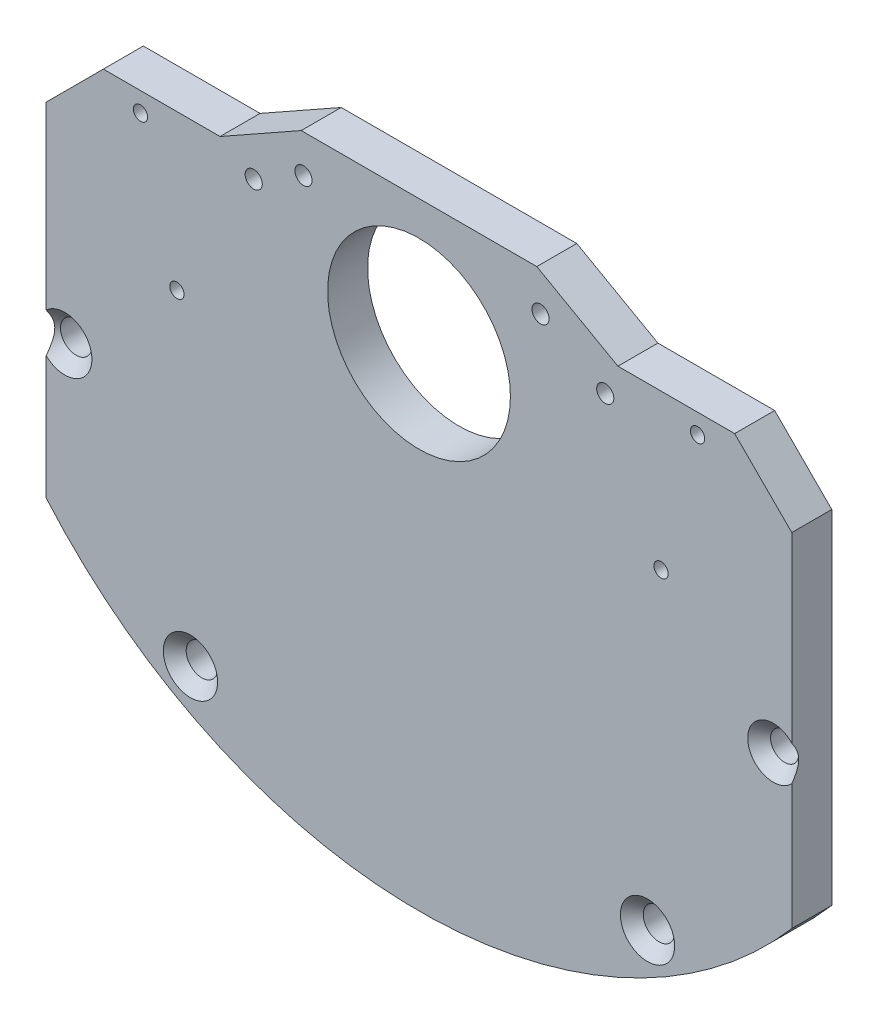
ISO-10303-21;
HEADER;
FILE_DESCRIPTION(('STEP AP214'),'2;1');
FILE_NAME('part.step','',(''),(''),'','','');
FILE_SCHEMA(('AUTOMOTIVE_DESIGN { 1 0 10303 214 1 1 1 1 }'));
ENDSEC;
DATA;
#1=APPLICATION_CONTEXT('core data for automotive mechanical design processes');
#2=APPLICATION_PROTOCOL_DEFINITION('international standard','automotive_design',2000,#1);
#3=PRODUCT_CONTEXT('',#1,'mechanical');
#4=PRODUCT('Part','Part','',(#3));
#5=PRODUCT_RELATED_PRODUCT_CATEGORY('part','',(#4));
#6=PRODUCT_DEFINITION_FORMATION('','',#4);
#7=PRODUCT_DEFINITION_CONTEXT('part definition',#1,'design');
#8=PRODUCT_DEFINITION('design','',#6,#7);
#9=PRODUCT_DEFINITION_SHAPE('','',#8);
#10=(LENGTH_UNIT() NAMED_UNIT(*) SI_UNIT(.MILLI.,.METRE.));
#11=(NAMED_UNIT(*) PLANE_ANGLE_UNIT() SI_UNIT($,.RADIAN.));
#12=(NAMED_UNIT(*) SI_UNIT($,.STERADIAN.) SOLID_ANGLE_UNIT());
#13=UNCERTAINTY_MEASURE_WITH_UNIT(LENGTH_MEASURE(1.E-05),#10,'distance_accuracy_value','');
#14=(GEOMETRIC_REPRESENTATION_CONTEXT(3) GLOBAL_UNCERTAINTY_ASSIGNED_CONTEXT((#13)) GLOBAL_UNIT_ASSIGNED_CONTEXT((#10,
#11,#12)) REPRESENTATION_CONTEXT('',''));
#15=CARTESIAN_POINT('',(0.,0.,0.));
#16=DIRECTION('',(0.,0.,1.));
#17=DIRECTION('',(1.,0.,0.));
#18=AXIS2_PLACEMENT_3D('',#15,#16,#17);
#19=CARTESIAN_POINT('',(0.,0.,7.));
#20=DIRECTION('',(0.,0.,1.));
#21=DIRECTION('',(1.,0.,0.));
#22=AXIS2_PLACEMENT_3D('',#19,#20,#21);
#23=PLANE('',#22);
#24=CARTESIAN_POINT('',(-48.7540525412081,10.5767367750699,7.));
#25=DIRECTION('',(0.,0.,1.));
#26=DIRECTION('',(1.,0.,0.));
#27=AXIS2_PLACEMENT_3D('',#24,#25,#26);
#28=CIRCLE('',#27,1.24999999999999);
#29=CARTESIAN_POINT('',(-47.5040525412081,10.5767367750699,7.));
#30=VERTEX_POINT('',#29);
#31=EDGE_CURVE('E371',#30,#30,#28,.T.);
#32=ORIENTED_EDGE('',*,*,#31,.F.);
#33=EDGE_LOOP('',(#32));
#34=FACE_BOUND('',#33,.T.);
#35=CARTESIAN_POINT('',(-42.3670414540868,-13.0919363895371,7.));
#36=DIRECTION('',(0.,0.,1.));
#37=DIRECTION('',(1.,0.,0.));
#38=AXIS2_PLACEMENT_3D('',#35,#36,#37);
#39=CIRCLE('',#38,1.24999999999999);
#40=CARTESIAN_POINT('',(-41.1170414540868,-13.0919363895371,7.));
#41=VERTEX_POINT('',#40);
#42=EDGE_CURVE('E365',#41,#41,#39,.T.);
#43=ORIENTED_EDGE('',*,*,#42,.F.);
#44=EDGE_LOOP('',(#43));
#45=FACE_BOUND('',#44,.T.);
#46=CARTESIAN_POINT('',(48.7540525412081,10.5767367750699,7.));
#47=DIRECTION('',(0.,0.,1.));
#48=DIRECTION('',(1.,0.,0.));
#49=AXIS2_PLACEMENT_3D('',#46,#47,#48);
#50=CIRCLE('',#49,1.24999999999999);
#51=CARTESIAN_POINT('',(50.0040525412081,10.5767367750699,7.));
#52=VERTEX_POINT('',#51);
#53=EDGE_CURVE('E359',#52,#52,#50,.T.);
#54=ORIENTED_EDGE('',*,*,#53,.F.);
#55=EDGE_LOOP('',(#54));
#56=FACE_BOUND('',#55,.T.);
#57=CARTESIAN_POINT('',(42.3670414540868,-13.0919363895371,7.));
#58=DIRECTION('',(0.,0.,1.));
#59=DIRECTION('',(1.,0.,0.));
#60=AXIS2_PLACEMENT_3D('',#57,#58,#59);
#61=CIRCLE('',#60,1.24999999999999);
#62=CARTESIAN_POINT('',(43.6170414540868,-13.0919363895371,7.));
#63=VERTEX_POINT('',#62);
#64=EDGE_CURVE('E353',#63,#63,#61,.T.);
#65=ORIENTED_EDGE('',*,*,#64,.F.);
#66=EDGE_LOOP('',(#65));
#67=FACE_BOUND('',#66,.T.);
#68=CARTESIAN_POINT('',(40.,-68.9092960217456,7.));
#69=DIRECTION('',(0.,0.,1.));
#70=DIRECTION('',(1.,0.,0.));
#71=AXIS2_PLACEMENT_3D('',#68,#69,#70);
#72=CIRCLE('',#71,4.75000000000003);
#73=CARTESIAN_POINT('',(44.75,-68.9092960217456,7.));
#74=VERTEX_POINT('',#73);
#75=EDGE_CURVE('E180',#74,#74,#72,.F.);
#76=ORIENTED_EDGE('',*,*,#75,.T.);
#77=EDGE_LOOP('',(#76));
#78=FACE_BOUND('',#77,.T.);
#79=CARTESIAN_POINT('',(-40.,-68.9092960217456,7.));
#80=DIRECTION('',(0.,0.,1.));
#81=DIRECTION('',(1.,0.,0.));
#82=AXIS2_PLACEMENT_3D('',#79,#80,#81);
#83=CIRCLE('',#82,4.75000000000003);
#84=CARTESIAN_POINT('',(-35.25,-68.9092960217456,7.));
#85=VERTEX_POINT('',#84);
#86=EDGE_CURVE('E177',#85,#85,#83,.F.);
#87=ORIENTED_EDGE('',*,*,#86,.T.);
#88=EDGE_LOOP('',(#87));
#89=FACE_BOUND('',#88,.T.);
#90=CARTESIAN_POINT('',(-28.9317067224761,10.4718143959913,7.));
#91=DIRECTION('',(0.,0.,-1.));
#92=DIRECTION('',(-1.,0.,0.));
#93=AXIS2_PLACEMENT_3D('',#90,#91,#92);
#94=CIRCLE('',#93,1.5);
#95=CARTESIAN_POINT('',(-30.4317067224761,10.4718143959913,7.));
#96=VERTEX_POINT('',#95);
#97=EDGE_CURVE('E344',#96,#96,#94,.T.);
#98=ORIENTED_EDGE('',*,*,#97,.T.);
#99=EDGE_LOOP('',(#98));
#100=FACE_BOUND('',#99,.T.);
#101=CARTESIAN_POINT('',(-20.2190182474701,15.3798750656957,7.));
#102=DIRECTION('',(0.,0.,-1.));
#103=DIRECTION('',(-1.,0.,0.));
#104=AXIS2_PLACEMENT_3D('',#101,#102,#103);
#105=CIRCLE('',#104,1.5);
#106=CARTESIAN_POINT('',(-21.7190182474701,15.3798750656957,7.));
#107=VERTEX_POINT('',#106);
#108=EDGE_CURVE('E338',#107,#107,#105,.T.);
#109=ORIENTED_EDGE('',*,*,#108,.T.);
#110=EDGE_LOOP('',(#109));
#111=FACE_BOUND('',#110,.T.);
#112=CARTESIAN_POINT('',(32.5976371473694,8.7558016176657,7.));
#113=DIRECTION('',(0.,0.,-1.));
#114=DIRECTION('',(-1.,0.,0.));
#115=AXIS2_PLACEMENT_3D('',#112,#113,#114);
#116=CIRCLE('',#115,1.5);
#117=CARTESIAN_POINT('',(31.0976371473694,8.7558016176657,7.));
#118=VERTEX_POINT('',#117);
#119=EDGE_CURVE('E332',#118,#118,#116,.T.);
#120=ORIENTED_EDGE('',*,*,#119,.T.);
#121=EDGE_LOOP('',(#120));
#122=FACE_BOUND('',#121,.T.);
#123=CARTESIAN_POINT('',(21.2711421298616,15.1362804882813,7.));
#124=DIRECTION('',(0.,0.,-1.));
#125=DIRECTION('',(-1.,0.,0.));
#126=AXIS2_PLACEMENT_3D('',#123,#124,#125);
#127=CIRCLE('',#126,1.5);
#128=CARTESIAN_POINT('',(19.7711421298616,15.1362804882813,7.));
#129=VERTEX_POINT('',#128);
#130=EDGE_CURVE('E326',#129,#129,#127,.T.);
#131=ORIENTED_EDGE('',*,*,#130,.T.);
#132=EDGE_LOOP('',(#131));
#133=FACE_BOUND('',#132,.T.);
#134=DIRECTION('',(0.,1.,0.));
#135=VECTOR('',#134,1.);
#136=CARTESIAN_POINT('',(65.2499999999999,4.,7.));
#137=LINE('',#136,#135);
#138=CARTESIAN_POINT('',(65.2499999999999,-56.0217591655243,7.));
#139=VERTEX_POINT('',#138);
#140=CARTESIAN_POINT('',(65.2499999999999,-34.0659130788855,7.));
#141=VERTEX_POINT('',#140);
#142=EDGE_CURVE('E125',#139,#141,#137,.T.);
#143=ORIENTED_EDGE('',*,*,#142,.T.);
#144=CARTESIAN_POINT('',(62.,-31.,7.));
#145=DIRECTION('',(0.,0.,1.));
#146=DIRECTION('',(1.,0.,0.));
#147=AXIS2_PLACEMENT_3D('',#144,#145,#146);
#148=CIRCLE('',#147,4.46792155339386);
#149=CARTESIAN_POINT('',(65.2499999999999,-27.9340869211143,7.));
#150=VERTEX_POINT('',#149);
#151=EDGE_CURVE('E183',#141,#150,#148,.F.);
#152=ORIENTED_EDGE('',*,*,#151,.T.);
#153=CARTESIAN_POINT('',(65.2499999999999,4.,7.));
#154=VERTEX_POINT('',#153);
#155=EDGE_CURVE('E137',#150,#154,#137,.T.);
#156=ORIENTED_EDGE('',*,*,#155,.T.);
#157=DIRECTION('',(-0.707106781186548,0.707106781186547,0.));
#158=VECTOR('',#157,1.);
#159=CARTESIAN_POINT('',(55.2499999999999,14.,7.));
#160=LINE('',#159,#158);
#161=CARTESIAN_POINT('',(55.2499999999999,14.,7.));
#162=VERTEX_POINT('',#161);
#163=EDGE_CURVE('E136',#154,#162,#160,.T.);
#164=ORIENTED_EDGE('',*,*,#163,.T.);
#165=DIRECTION('',(-1.,0.,0.));
#166=VECTOR('',#165,1.);
#167=CARTESIAN_POINT('',(34.8183521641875,14.,7.));
#168=LINE('',#167,#166);
#169=CARTESIAN_POINT('',(34.8183521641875,14.,7.));
#170=VERTEX_POINT('',#169);
#171=EDGE_CURVE('E307',#162,#170,#168,.T.);
#172=ORIENTED_EDGE('',*,*,#171,.T.);
#173=DIRECTION('',(-0.871268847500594,0.490806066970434,0.));
#174=VECTOR('',#173,1.);
#175=CARTESIAN_POINT('',(20.616916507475,22.,7.));
#176=LINE('',#175,#174);
#177=CARTESIAN_POINT('',(20.616916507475,22.,7.));
#178=VERTEX_POINT('',#177);
#179=EDGE_CURVE('E266',#170,#178,#176,.T.);
#180=ORIENTED_EDGE('',*,*,#179,.T.);
#181=DIRECTION('',(-1.,0.,0.));
#182=VECTOR('',#181,1.);
#183=CARTESIAN_POINT('',(-20.6169165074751,22.,7.));
#184=LINE('',#183,#182);
#185=CARTESIAN_POINT('',(-20.6169165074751,22.,7.));
#186=VERTEX_POINT('',#185);
#187=EDGE_CURVE('E301',#178,#186,#184,.T.);
#188=ORIENTED_EDGE('',*,*,#187,.T.);
#189=DIRECTION('',(-0.871268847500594,-0.490806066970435,0.));
#190=VECTOR('',#189,1.);
#191=CARTESIAN_POINT('',(-20.6169165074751,22.,7.));
#192=LINE('',#191,#190);
#193=CARTESIAN_POINT('',(-34.8183521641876,14.,7.));
#194=VERTEX_POINT('',#193);
#195=EDGE_CURVE('E303',#186,#194,#192,.T.);
#196=ORIENTED_EDGE('',*,*,#195,.T.);
#197=DIRECTION('',(-1.,0.,0.));
#198=VECTOR('',#197,1.);
#199=CARTESIAN_POINT('',(-55.25,14.,7.));
#200=LINE('',#199,#198);
#201=CARTESIAN_POINT('',(-55.25,14.,7.));
#202=VERTEX_POINT('',#201);
#203=EDGE_CURVE('E305',#194,#202,#200,.T.);
#204=ORIENTED_EDGE('',*,*,#203,.T.);
#205=DIRECTION('',(-0.707106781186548,-0.707106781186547,0.));
#206=VECTOR('',#205,1.);
#207=CARTESIAN_POINT('',(-55.25,14.,7.));
#208=LINE('',#207,#206);
#209=CARTESIAN_POINT('',(-65.25,4.,7.));
#210=VERTEX_POINT('',#209);
#211=EDGE_CURVE('E312',#202,#210,#208,.T.);
#212=ORIENTED_EDGE('',*,*,#211,.T.);
#213=DIRECTION('',(0.,-1.,0.));
#214=VECTOR('',#213,1.);
#215=CARTESIAN_POINT('',(-65.25,4.,7.));
#216=LINE('',#215,#214);
#217=CARTESIAN_POINT('',(-65.25,-27.5358983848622,7.));
#218=VERTEX_POINT('',#217);
#219=EDGE_CURVE('E287',#210,#218,#216,.T.);
#220=ORIENTED_EDGE('',*,*,#219,.T.);
#221=CARTESIAN_POINT('',(-62.,-31.,7.));
#222=DIRECTION('',(0.,0.,1.));
#223=DIRECTION('',(1.,0.,0.));
#224=AXIS2_PLACEMENT_3D('',#221,#222,#223);
#225=CIRCLE('',#224,4.75000000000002);
#226=CARTESIAN_POINT('',(-65.25,-34.4641016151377,7.));
#227=VERTEX_POINT('',#226);
#228=EDGE_CURVE('E155',#218,#227,#225,.F.);
#229=ORIENTED_EDGE('',*,*,#228,.T.);
#230=CARTESIAN_POINT('',(-65.25,-56.0217591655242,7.));
#231=VERTEX_POINT('',#230);
#232=EDGE_CURVE('E142',#227,#231,#216,.T.);
#233=ORIENTED_EDGE('',*,*,#232,.T.);
#234=CARTESIAN_POINT('',(0.,0.,7.));
#235=DIRECTION('',(0.,0.,1.));
#236=DIRECTION('',(1.,0.,0.));
#237=AXIS2_PLACEMENT_3D('',#234,#235,#236);
#238=CIRCLE('',#237,86.);
#239=EDGE_CURVE('E140',#231,#139,#238,.T.);
#240=ORIENTED_EDGE('',*,*,#239,.T.);
#241=EDGE_LOOP('',(#143,#152,#156,#164,#172,#180,#188,#196,#204,#212,#220,#229,#233,#240));
#242=FACE_BOUND('',#241,.T.);
#243=CARTESIAN_POINT('',(0.,0.,7.));
#244=DIRECTION('',(0.,0.,1.));
#245=DIRECTION('',(1.,0.,0.));
#246=AXIS2_PLACEMENT_3D('',#243,#244,#245);
#247=CIRCLE('',#246,16.);
#248=CARTESIAN_POINT('',(16.,0.,7.));
#249=VERTEX_POINT('',#248);
#250=EDGE_CURVE('E317',#249,#249,#247,.T.);
#251=ORIENTED_EDGE('',*,*,#250,.F.);
#252=EDGE_LOOP('',(#251));
#253=FACE_BOUND('',#252,.T.);
#254=ADVANCED_FACE('F33',(#34,#45,#56,#67,#78,#89,#100,#111,#122,#133,#242,#253),#23,.T.);
#255=CARTESIAN_POINT('',(0.,0.,0.));
#256=DIRECTION('',(0.,0.,1.));
#257=DIRECTION('',(1.,0.,0.));
#258=AXIS2_PLACEMENT_3D('',#255,#256,#257);
#259=PLANE('',#258);
#260=CARTESIAN_POINT('',(-48.7540525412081,10.5767367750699,0.));
#261=DIRECTION('',(0.,0.,1.));
#262=DIRECTION('',(1.,0.,0.));
#263=AXIS2_PLACEMENT_3D('',#260,#261,#262);
#264=CIRCLE('',#263,1.25);
#265=CARTESIAN_POINT('',(-47.5040525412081,10.5767367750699,0.));
#266=VERTEX_POINT('',#265);
#267=EDGE_CURVE('E368',#266,#266,#264,.T.);
#268=ORIENTED_EDGE('',*,*,#267,.T.);
#269=EDGE_LOOP('',(#268));
#270=FACE_BOUND('',#269,.T.);
#271=CARTESIAN_POINT('',(-42.3670414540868,-13.0919363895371,0.));
#272=DIRECTION('',(0.,0.,1.));
#273=DIRECTION('',(1.,0.,0.));
#274=AXIS2_PLACEMENT_3D('',#271,#272,#273);
#275=CIRCLE('',#274,1.25);
#276=CARTESIAN_POINT('',(-41.1170414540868,-13.0919363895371,0.));
#277=VERTEX_POINT('',#276);
#278=EDGE_CURVE('E362',#277,#277,#275,.T.);
#279=ORIENTED_EDGE('',*,*,#278,.T.);
#280=EDGE_LOOP('',(#279));
#281=FACE_BOUND('',#280,.T.);
#282=CARTESIAN_POINT('',(48.7540525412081,10.5767367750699,0.));
#283=DIRECTION('',(0.,0.,1.));
#284=DIRECTION('',(1.,0.,0.));
#285=AXIS2_PLACEMENT_3D('',#282,#283,#284);
#286=CIRCLE('',#285,1.25);
#287=CARTESIAN_POINT('',(50.0040525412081,10.5767367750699,0.));
#288=VERTEX_POINT('',#287);
#289=EDGE_CURVE('E356',#288,#288,#286,.T.);
#290=ORIENTED_EDGE('',*,*,#289,.T.);
#291=EDGE_LOOP('',(#290));
#292=FACE_BOUND('',#291,.T.);
#293=CARTESIAN_POINT('',(42.3670414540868,-13.0919363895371,0.));
#294=DIRECTION('',(0.,0.,1.));
#295=DIRECTION('',(1.,0.,0.));
#296=AXIS2_PLACEMENT_3D('',#293,#294,#295);
#297=CIRCLE('',#296,1.25);
#298=CARTESIAN_POINT('',(43.6170414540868,-13.0919363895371,0.));
#299=VERTEX_POINT('',#298);
#300=EDGE_CURVE('E174',#299,#299,#297,.T.);
#301=ORIENTED_EDGE('',*,*,#300,.T.);
#302=EDGE_LOOP('',(#301));
#303=FACE_BOUND('',#302,.T.);
#304=CARTESIAN_POINT('',(62.,-31.,0.));
#305=DIRECTION('',(0.,0.,1.));
#306=DIRECTION('',(1.,0.,0.));
#307=AXIS2_PLACEMENT_3D('',#304,#305,#306);
#308=CIRCLE('',#307,2.46792155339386);
#309=CARTESIAN_POINT('',(64.4679215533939,-31.,0.));
#310=VERTEX_POINT('',#309);
#311=EDGE_CURVE('E172',#310,#310,#308,.T.);
#312=ORIENTED_EDGE('',*,*,#311,.T.);
#313=EDGE_LOOP('',(#312));
#314=FACE_BOUND('',#313,.T.);
#315=CARTESIAN_POINT('',(-62.,-31.,0.));
#316=DIRECTION('',(0.,0.,1.));
#317=DIRECTION('',(1.,0.,0.));
#318=AXIS2_PLACEMENT_3D('',#315,#316,#317);
#319=CIRCLE('',#318,2.75);
#320=CARTESIAN_POINT('',(-59.25,-31.,0.));
#321=VERTEX_POINT('',#320);
#322=EDGE_CURVE('E169',#321,#321,#319,.T.);
#323=ORIENTED_EDGE('',*,*,#322,.T.);
#324=EDGE_LOOP('',(#323));
#325=FACE_BOUND('',#324,.T.);
#326=CARTESIAN_POINT('',(40.,-68.9092960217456,0.));
#327=DIRECTION('',(0.,0.,1.));
#328=DIRECTION('',(1.,0.,0.));
#329=AXIS2_PLACEMENT_3D('',#326,#327,#328);
#330=CIRCLE('',#329,2.75);
#331=CARTESIAN_POINT('',(42.75,-68.9092960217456,0.));
#332=VERTEX_POINT('',#331);
#333=EDGE_CURVE('E166',#332,#332,#330,.T.);
#334=ORIENTED_EDGE('',*,*,#333,.T.);
#335=EDGE_LOOP('',(#334));
#336=FACE_BOUND('',#335,.T.);
#337=CARTESIAN_POINT('',(-40.,-68.9092960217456,0.));
#338=DIRECTION('',(0.,0.,1.));
#339=DIRECTION('',(1.,0.,0.));
#340=AXIS2_PLACEMENT_3D('',#337,#338,#339);
#341=CIRCLE('',#340,2.75);
#342=CARTESIAN_POINT('',(-37.25,-68.9092960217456,0.));
#343=VERTEX_POINT('',#342);
#344=EDGE_CURVE('E162',#343,#343,#341,.T.);
#345=ORIENTED_EDGE('',*,*,#344,.T.);
#346=EDGE_LOOP('',(#345));
#347=FACE_BOUND('',#346,.T.);
#348=CARTESIAN_POINT('',(-28.9317067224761,10.4718143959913,0.));
#349=DIRECTION('',(0.,0.,-1.));
#350=DIRECTION('',(-1.,0.,0.));
#351=AXIS2_PLACEMENT_3D('',#348,#349,#350);
#352=CIRCLE('',#351,1.5);
#353=CARTESIAN_POINT('',(-30.4317067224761,10.4718143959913,0.));
#354=VERTEX_POINT('',#353);
#355=EDGE_CURVE('E165',#354,#354,#352,.T.);
#356=ORIENTED_EDGE('',*,*,#355,.F.);
#357=EDGE_LOOP('',(#356));
#358=FACE_BOUND('',#357,.T.);
#359=CARTESIAN_POINT('',(-20.2190182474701,15.3798750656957,0.));
#360=DIRECTION('',(0.,0.,-1.));
#361=DIRECTION('',(-1.,0.,0.));
#362=AXIS2_PLACEMENT_3D('',#359,#360,#361);
#363=CIRCLE('',#362,1.5);
#364=CARTESIAN_POINT('',(-21.7190182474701,15.3798750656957,0.));
#365=VERTEX_POINT('',#364);
#366=EDGE_CURVE('E341',#365,#365,#363,.T.);
#367=ORIENTED_EDGE('',*,*,#366,.F.);
#368=EDGE_LOOP('',(#367));
#369=FACE_BOUND('',#368,.T.);
#370=CARTESIAN_POINT('',(32.5976371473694,8.7558016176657,0.));
#371=DIRECTION('',(0.,0.,-1.));
#372=DIRECTION('',(-1.,0.,0.));
#373=AXIS2_PLACEMENT_3D('',#370,#371,#372);
#374=CIRCLE('',#373,1.5);
#375=CARTESIAN_POINT('',(31.0976371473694,8.7558016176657,0.));
#376=VERTEX_POINT('',#375);
#377=EDGE_CURVE('E335',#376,#376,#374,.T.);
#378=ORIENTED_EDGE('',*,*,#377,.F.);
#379=EDGE_LOOP('',(#378));
#380=FACE_BOUND('',#379,.T.);
#381=CARTESIAN_POINT('',(21.2711421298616,15.1362804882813,0.));
#382=DIRECTION('',(0.,0.,-1.));
#383=DIRECTION('',(-1.,0.,0.));
#384=AXIS2_PLACEMENT_3D('',#381,#382,#383);
#385=CIRCLE('',#384,1.5);
#386=CARTESIAN_POINT('',(19.7711421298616,15.1362804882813,0.));
#387=VERTEX_POINT('',#386);
#388=EDGE_CURVE('E329',#387,#387,#385,.T.);
#389=ORIENTED_EDGE('',*,*,#388,.F.);
#390=EDGE_LOOP('',(#389));
#391=FACE_BOUND('',#390,.T.);
#392=CARTESIAN_POINT('',(0.,0.,0.));
#393=DIRECTION('',(0.,0.,1.));
#394=DIRECTION('',(1.,0.,0.));
#395=AXIS2_PLACEMENT_3D('',#392,#393,#394);
#396=CIRCLE('',#395,86.);
#397=CARTESIAN_POINT('',(-65.25,-56.0217591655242,0.));
#398=VERTEX_POINT('',#397);
#399=CARTESIAN_POINT('',(65.2499999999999,-56.0217591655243,0.));
#400=VERTEX_POINT('',#399);
#401=EDGE_CURVE('E150',#398,#400,#396,.T.);
#402=ORIENTED_EDGE('',*,*,#401,.F.);
#403=DIRECTION('',(0.,-1.,0.));
#404=VECTOR('',#403,1.);
#405=CARTESIAN_POINT('',(-65.25,4.,0.));
#406=LINE('',#405,#404);
#407=CARTESIAN_POINT('',(-65.25,4.,0.));
#408=VERTEX_POINT('',#407);
#409=EDGE_CURVE('E146',#408,#398,#406,.T.);
#410=ORIENTED_EDGE('',*,*,#409,.F.);
#411=DIRECTION('',(-0.707106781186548,-0.707106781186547,0.));
#412=VECTOR('',#411,1.);
#413=CARTESIAN_POINT('',(-55.25,14.,0.));
#414=LINE('',#413,#412);
#415=CARTESIAN_POINT('',(-55.25,14.,0.));
#416=VERTEX_POINT('',#415);
#417=EDGE_CURVE('E281',#416,#408,#414,.T.);
#418=ORIENTED_EDGE('',*,*,#417,.F.);
#419=DIRECTION('',(-1.,0.,0.));
#420=VECTOR('',#419,1.);
#421=CARTESIAN_POINT('',(-55.25,14.,0.));
#422=LINE('',#421,#420);
#423=CARTESIAN_POINT('',(-34.8183521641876,14.,0.));
#424=VERTEX_POINT('',#423);
#425=EDGE_CURVE('E279',#424,#416,#422,.T.);
#426=ORIENTED_EDGE('',*,*,#425,.F.);
#427=DIRECTION('',(-0.871268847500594,-0.490806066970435,0.));
#428=VECTOR('',#427,1.);
#429=CARTESIAN_POINT('',(-20.6169165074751,22.,0.));
#430=LINE('',#429,#428);
#431=CARTESIAN_POINT('',(-20.6169165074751,22.,0.));
#432=VERTEX_POINT('',#431);
#433=EDGE_CURVE('E274',#432,#424,#430,.T.);
#434=ORIENTED_EDGE('',*,*,#433,.F.);
#435=DIRECTION('',(-1.,0.,0.));
#436=VECTOR('',#435,1.);
#437=CARTESIAN_POINT('',(-20.6169165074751,22.,0.));
#438=LINE('',#437,#436);
#439=CARTESIAN_POINT('',(20.616916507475,22.,0.));
#440=VERTEX_POINT('',#439);
#441=EDGE_CURVE('E272',#440,#432,#438,.T.);
#442=ORIENTED_EDGE('',*,*,#441,.F.);
#443=DIRECTION('',(-0.871268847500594,0.490806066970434,0.));
#444=VECTOR('',#443,1.);
#445=CARTESIAN_POINT('',(20.616916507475,22.,0.));
#446=LINE('',#445,#444);
#447=CARTESIAN_POINT('',(34.8183521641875,14.,0.));
#448=VERTEX_POINT('',#447);
#449=EDGE_CURVE('E261',#448,#440,#446,.T.);
#450=ORIENTED_EDGE('',*,*,#449,.F.);
#451=DIRECTION('',(-1.,0.,0.));
#452=VECTOR('',#451,1.);
#453=CARTESIAN_POINT('',(34.8183521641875,14.,0.));
#454=LINE('',#453,#452);
#455=CARTESIAN_POINT('',(55.2499999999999,14.,0.));
#456=VERTEX_POINT('',#455);
#457=EDGE_CURVE('E252',#456,#448,#454,.T.);
#458=ORIENTED_EDGE('',*,*,#457,.F.);
#459=DIRECTION('',(-0.707106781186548,0.707106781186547,0.));
#460=VECTOR('',#459,1.);
#461=CARTESIAN_POINT('',(55.2499999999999,14.,0.));
#462=LINE('',#461,#460);
#463=CARTESIAN_POINT('',(65.2499999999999,4.,0.));
#464=VERTEX_POINT('',#463);
#465=EDGE_CURVE('E262',#464,#456,#462,.T.);
#466=ORIENTED_EDGE('',*,*,#465,.F.);
#467=DIRECTION('',(0.,1.,0.));
#468=VECTOR('',#467,1.);
#469=CARTESIAN_POINT('',(65.2499999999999,4.,0.));
#470=LINE('',#469,#468);
#471=EDGE_CURVE('E316',#400,#464,#470,.T.);
#472=ORIENTED_EDGE('',*,*,#471,.F.);
#473=EDGE_LOOP('',(#402,#410,#418,#426,#434,#442,#450,#458,#466,#472));
#474=FACE_BOUND('',#473,.T.);
#475=CARTESIAN_POINT('',(0.,0.,0.));
#476=DIRECTION('',(0.,0.,1.));
#477=DIRECTION('',(1.,0.,0.));
#478=AXIS2_PLACEMENT_3D('',#475,#476,#477);
#479=CIRCLE('',#478,16.);
#480=CARTESIAN_POINT('',(16.,0.,0.));
#481=VERTEX_POINT('',#480);
#482=EDGE_CURVE('E323',#481,#481,#479,.T.);
#483=ORIENTED_EDGE('',*,*,#482,.T.);
#484=EDGE_LOOP('',(#483));
#485=FACE_BOUND('',#484,.T.);
#486=ADVANCED_FACE('F203',(#270,#281,#292,#303,#314,#325,#336,#347,#358,#369,#380,#391,#474,
#485),#259,.F.);
#487=CARTESIAN_POINT('',(0.,0.,7.));
#488=DIRECTION('',(0.,0.,-1.));
#489=DIRECTION('',(-1.,0.,0.));
#490=AXIS2_PLACEMENT_3D('',#487,#488,#489);
#491=CYLINDRICAL_SURFACE('',#490,86.);
#492=ORIENTED_EDGE('',*,*,#401,.T.);
#493=DIRECTION('',(0.,0.,-1.));
#494=VECTOR('',#493,1.);
#495=CARTESIAN_POINT('',(65.2499999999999,-56.0217591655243,7.));
#496=LINE('',#495,#494);
#497=EDGE_CURVE('E130',#139,#400,#496,.T.);
#498=ORIENTED_EDGE('',*,*,#497,.F.);
#499=ORIENTED_EDGE('',*,*,#239,.F.);
#500=DIRECTION('',(0.,0.,-1.));
#501=VECTOR('',#500,1.);
#502=CARTESIAN_POINT('',(-65.25,-56.0217591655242,7.));
#503=LINE('',#502,#501);
#504=EDGE_CURVE('E284',#231,#398,#503,.T.);
#505=ORIENTED_EDGE('',*,*,#504,.T.);
#506=EDGE_LOOP('',(#492,#498,#499,#505));
#507=FACE_BOUND('',#506,.T.);
#508=ADVANCED_FACE('F148',(#507),#491,.T.);
#509=CARTESIAN_POINT('',(65.2499999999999,4.,7.));
#510=DIRECTION('',(-1.,0.,0.));
#511=DIRECTION('',(0.,-1.,0.));
#512=AXIS2_PLACEMENT_3D('',#509,#510,#511);
#513=PLANE('',#512);
#514=ORIENTED_EDGE('',*,*,#155,.F.);
#515=CARTESIAN_POINT('',(65.2499999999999,-27.9340869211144,7.));
#516=CARTESIAN_POINT('',(65.2499999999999,-28.0239770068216,6.93833885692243));
#517=CARTESIAN_POINT('',(65.2499999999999,-28.1145283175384,6.87761683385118));
#518=CARTESIAN_POINT('',(65.2499999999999,-28.2972185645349,6.758504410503));
#519=CARTESIAN_POINT('',(65.2499999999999,-28.3893583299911,6.70011528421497));
#520=CARTESIAN_POINT('',(65.2499999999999,-28.5766630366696,6.5854125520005));
#521=CARTESIAN_POINT('',(65.2499999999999,-28.6718520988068,6.52913812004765));
#522=CARTESIAN_POINT('',(65.2499999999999,-28.8642716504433,6.42020686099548));
#523=CARTESIAN_POINT('',(65.2499999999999,-28.9615018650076,6.36754955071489));
#524=CARTESIAN_POINT('',(65.2499999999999,-29.1601102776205,6.26574797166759));
#525=CARTESIAN_POINT('',(65.2499999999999,-29.2615320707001,6.2166881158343));
#526=CARTESIAN_POINT('',(65.2499999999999,-29.4670050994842,6.12431349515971));
#527=CARTESIAN_POINT('',(65.2499999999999,-29.5710567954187,6.08099974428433));
#528=CARTESIAN_POINT('',(65.2499999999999,-29.7813019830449,6.00170427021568));
#529=CARTESIAN_POINT('',(65.2499999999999,-29.8874807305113,5.96568391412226));
#530=CARTESIAN_POINT('',(65.2499999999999,-30.102335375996,5.90221013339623));
#531=CARTESIAN_POINT('',(65.2499999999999,-30.2110096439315,5.87475127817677));
#532=CARTESIAN_POINT('',(65.2499999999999,-30.4261315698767,5.830743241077));
#533=CARTESIAN_POINT('',(65.2499999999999,-30.5324990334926,5.81380792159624));
#534=CARTESIAN_POINT('',(65.2499999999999,-30.7464276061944,5.79022257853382));
#535=CARTESIAN_POINT('',(65.2499999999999,-30.8539891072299,5.7835760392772));
#536=CARTESIAN_POINT('',(65.2499999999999,-31.0679495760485,5.78104944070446));
#537=CARTESIAN_POINT('',(65.2499999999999,-31.1743470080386,5.7850411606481));
#538=CARTESIAN_POINT('',(65.2499999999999,-31.3862484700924,5.80324535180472));
#539=CARTESIAN_POINT('',(65.2499999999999,-31.4917524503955,5.8174583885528));
#540=CARTESIAN_POINT('',(65.2499999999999,-31.7247903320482,5.85952189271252));
#541=CARTESIAN_POINT('',(65.2499999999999,-31.8518953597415,5.88973376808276));
#542=CARTESIAN_POINT('',(65.2499999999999,-32.1027008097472,5.96194447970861));
#543=CARTESIAN_POINT('',(65.2499999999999,-32.2263993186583,6.00394979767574));
#544=CARTESIAN_POINT('',(65.2499999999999,-32.4716371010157,6.09791968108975));
#545=CARTESIAN_POINT('',(65.2499999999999,-32.5931313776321,6.14999991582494));
#546=CARTESIAN_POINT('',(65.2499999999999,-32.8325695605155,6.26163456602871));
#547=CARTESIAN_POINT('',(65.2499999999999,-32.950514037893,6.32118777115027));
#548=CARTESIAN_POINT('',(65.2499999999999,-33.1539940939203,6.43038550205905));
#549=CARTESIAN_POINT('',(65.2499999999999,-33.2402214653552,6.47875608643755));
#550=CARTESIAN_POINT('',(65.2499999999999,-33.4110971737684,6.57819537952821));
#551=CARTESIAN_POINT('',(65.2499999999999,-33.4957455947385,6.62926394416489));
#552=CARTESIAN_POINT('',(65.2499999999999,-33.6619848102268,6.73261441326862));
#553=CARTESIAN_POINT('',(65.2499999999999,-33.7436029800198,6.78485249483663));
#554=CARTESIAN_POINT('',(65.2499999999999,-33.9056260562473,6.8911444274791));
#555=CARTESIAN_POINT('',(65.2499999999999,-33.9860312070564,6.94519790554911));
#556=CARTESIAN_POINT('',(65.2499999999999,-34.0659130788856,7.));
#557=B_SPLINE_CURVE_WITH_KNOTS('',3,(#515,#516,#517,#518,#519,#520,#521,#522,#523,#524,#525,
#526,#527,#528,#529,#530,#531,#532,#533,#534,#535,#536,#537,#538,#539,#540,#541,#542,#543,#544,
#545,#546,#547,#548,#549,#550,#551,#552,#553,#554,#555,#556),.UNSPECIFIED.,.F.,.F.,(4,2,2,2,2,2,
2,2,2,2,2,2,2,2,2,2,2,2,2,2,4),(0.,0.327033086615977,0.654242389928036,0.985914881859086,
1.3175429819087,1.65539098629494,1.99329852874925,2.32936645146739,2.6652207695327,
2.9878837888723,3.31065605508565,3.62955566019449,3.94847291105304,4.33969985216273,
4.73114223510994,5.12737855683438,5.52355078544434,5.8201034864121,6.11664036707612,
6.40732619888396,6.69795266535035),.UNSPECIFIED.);
#558=EDGE_CURVE('E132',#150,#141,#557,.T.);
#559=ORIENTED_EDGE('',*,*,#558,.T.);
#560=ORIENTED_EDGE('',*,*,#142,.F.);
#561=ORIENTED_EDGE('',*,*,#497,.T.);
#562=ORIENTED_EDGE('',*,*,#471,.T.);
#563=DIRECTION('',(0.,0.,-1.));
#564=VECTOR('',#563,1.);
#565=CARTESIAN_POINT('',(65.2499999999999,4.,7.));
#566=LINE('',#565,#564);
#567=EDGE_CURVE('E152',#154,#464,#566,.T.);
#568=ORIENTED_EDGE('',*,*,#567,.F.);
#569=EDGE_LOOP('',(#514,#559,#560,#561,#562,#568));
#570=FACE_BOUND('',#569,.T.);
#571=ADVANCED_FACE('F128',(#570),#513,.F.);
#572=CARTESIAN_POINT('',(55.2499999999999,14.,7.));
#573=DIRECTION('',(-0.707106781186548,-0.707106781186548,0.));
#574=DIRECTION('',(0.707106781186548,-0.707106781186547,0.));
#575=AXIS2_PLACEMENT_3D('',#572,#573,#574);
#576=PLANE('',#575);
#577=ORIENTED_EDGE('',*,*,#465,.T.);
#578=DIRECTION('',(0.,0.,-1.));
#579=VECTOR('',#578,1.);
#580=CARTESIAN_POINT('',(55.2499999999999,14.,7.));
#581=LINE('',#580,#579);
#582=EDGE_CURVE('E158',#162,#456,#581,.T.);
#583=ORIENTED_EDGE('',*,*,#582,.F.);
#584=ORIENTED_EDGE('',*,*,#163,.F.);
#585=ORIENTED_EDGE('',*,*,#567,.T.);
#586=EDGE_LOOP('',(#577,#583,#584,#585));
#587=FACE_BOUND('',#586,.T.);
#588=ADVANCED_FACE('F200',(#587),#576,.F.);
#589=CARTESIAN_POINT('',(34.8183521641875,14.,7.));
#590=DIRECTION('',(0.,-1.,0.));
#591=DIRECTION('',(0.,0.,-1.));
#592=AXIS2_PLACEMENT_3D('',#589,#590,#591);
#593=PLANE('',#592);
#594=ORIENTED_EDGE('',*,*,#457,.T.);
#595=DIRECTION('',(0.,0.,-1.));
#596=VECTOR('',#595,1.);
#597=CARTESIAN_POINT('',(34.8183521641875,14.,7.));
#598=LINE('',#597,#596);
#599=EDGE_CURVE('E255',#170,#448,#598,.T.);
#600=ORIENTED_EDGE('',*,*,#599,.F.);
#601=ORIENTED_EDGE('',*,*,#171,.F.);
#602=ORIENTED_EDGE('',*,*,#582,.T.);
#603=EDGE_LOOP('',(#594,#600,#601,#602));
#604=FACE_BOUND('',#603,.T.);
#605=ADVANCED_FACE('F241',(#604),#593,.F.);
#606=CARTESIAN_POINT('',(20.616916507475,22.,7.));
#607=DIRECTION('',(-0.490806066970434,-0.871268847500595,0.));
#608=DIRECTION('',(0.871268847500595,-0.490806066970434,0.));
#609=AXIS2_PLACEMENT_3D('',#606,#607,#608);
#610=PLANE('',#609);
#611=ORIENTED_EDGE('',*,*,#449,.T.);
#612=DIRECTION('',(0.,0.,-1.));
#613=VECTOR('',#612,1.);
#614=CARTESIAN_POINT('',(20.616916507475,22.,7.));
#615=LINE('',#614,#613);
#616=EDGE_CURVE('E267',#178,#440,#615,.T.);
#617=ORIENTED_EDGE('',*,*,#616,.F.);
#618=ORIENTED_EDGE('',*,*,#179,.F.);
#619=ORIENTED_EDGE('',*,*,#599,.T.);
#620=EDGE_LOOP('',(#611,#617,#618,#619));
#621=FACE_BOUND('',#620,.T.);
#622=ADVANCED_FACE('F238',(#621),#610,.F.);
#623=CARTESIAN_POINT('',(-20.6169165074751,22.,7.));
#624=DIRECTION('',(0.,-1.,0.));
#625=DIRECTION('',(1.,0.,0.));
#626=AXIS2_PLACEMENT_3D('',#623,#624,#625);
#627=PLANE('',#626);
#628=ORIENTED_EDGE('',*,*,#441,.T.);
#629=DIRECTION('',(0.,0.,-1.));
#630=VECTOR('',#629,1.);
#631=CARTESIAN_POINT('',(-20.6169165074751,22.,7.));
#632=LINE('',#631,#630);
#633=EDGE_CURVE('E296',#186,#432,#632,.T.);
#634=ORIENTED_EDGE('',*,*,#633,.F.);
#635=ORIENTED_EDGE('',*,*,#187,.F.);
#636=ORIENTED_EDGE('',*,*,#616,.T.);
#637=EDGE_LOOP('',(#628,#634,#635,#636));
#638=FACE_BOUND('',#637,.T.);
#639=ADVANCED_FACE('F234',(#638),#627,.F.);
#640=CARTESIAN_POINT('',(-20.6169165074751,22.,7.));
#641=DIRECTION('',(0.490806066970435,-0.871268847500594,0.));
#642=DIRECTION('',(0.871268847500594,0.490806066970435,0.));
#643=AXIS2_PLACEMENT_3D('',#640,#641,#642);
#644=PLANE('',#643);
#645=ORIENTED_EDGE('',*,*,#433,.T.);
#646=DIRECTION('',(0.,0.,-1.));
#647=VECTOR('',#646,1.);
#648=CARTESIAN_POINT('',(-34.8183521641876,14.,7.));
#649=LINE('',#648,#647);
#650=EDGE_CURVE('E293',#194,#424,#649,.T.);
#651=ORIENTED_EDGE('',*,*,#650,.F.);
#652=ORIENTED_EDGE('',*,*,#195,.F.);
#653=ORIENTED_EDGE('',*,*,#633,.T.);
#654=EDGE_LOOP('',(#645,#651,#652,#653));
#655=FACE_BOUND('',#654,.T.);
#656=ADVANCED_FACE('F230',(#655),#644,.F.);
#657=CARTESIAN_POINT('',(-55.25,14.,7.));
#658=DIRECTION('',(0.,-1.,0.));
#659=DIRECTION('',(0.,0.,-1.));
#660=AXIS2_PLACEMENT_3D('',#657,#658,#659);
#661=PLANE('',#660);
#662=ORIENTED_EDGE('',*,*,#425,.T.);
#663=DIRECTION('',(0.,0.,-1.));
#664=VECTOR('',#663,1.);
#665=CARTESIAN_POINT('',(-55.25,14.,7.));
#666=LINE('',#665,#664);
#667=EDGE_CURVE('E290',#202,#416,#666,.T.);
#668=ORIENTED_EDGE('',*,*,#667,.F.);
#669=ORIENTED_EDGE('',*,*,#203,.F.);
#670=ORIENTED_EDGE('',*,*,#650,.T.);
#671=EDGE_LOOP('',(#662,#668,#669,#670));
#672=FACE_BOUND('',#671,.T.);
#673=ADVANCED_FACE('F226',(#672),#661,.F.);
#674=CARTESIAN_POINT('',(-55.25,14.,7.));
#675=DIRECTION('',(0.707106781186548,-0.707106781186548,0.));
#676=DIRECTION('',(0.707106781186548,0.707106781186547,0.));
#677=AXIS2_PLACEMENT_3D('',#674,#675,#676);
#678=PLANE('',#677);
#679=ORIENTED_EDGE('',*,*,#417,.T.);
#680=DIRECTION('',(0.,0.,-1.));
#681=VECTOR('',#680,1.);
#682=CARTESIAN_POINT('',(-65.25,4.,7.));
#683=LINE('',#682,#681);
#684=EDGE_CURVE('E286',#210,#408,#683,.T.);
#685=ORIENTED_EDGE('',*,*,#684,.F.);
#686=ORIENTED_EDGE('',*,*,#211,.F.);
#687=ORIENTED_EDGE('',*,*,#667,.T.);
#688=EDGE_LOOP('',(#679,#685,#686,#687));
#689=FACE_BOUND('',#688,.T.);
#690=ADVANCED_FACE('F223',(#689),#678,.F.);
#691=CARTESIAN_POINT('',(-65.25,4.,7.));
#692=DIRECTION('',(1.,0.,0.));
#693=DIRECTION('',(0.,0.,-1.));
#694=AXIS2_PLACEMENT_3D('',#691,#692,#693);
#695=PLANE('',#694);
#696=ORIENTED_EDGE('',*,*,#232,.F.);
#697=CARTESIAN_POINT('',(-65.25,-34.4641016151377,7.));
#698=CARTESIAN_POINT('',(-65.25,-34.3719398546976,6.93280747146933));
#699=CARTESIAN_POINT('',(-65.25,-34.2791909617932,6.86640449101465));
#700=CARTESIAN_POINT('',(-65.25,-34.092276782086,6.73555140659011));
#701=CARTESIAN_POINT('',(-65.25,-33.9981109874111,6.67110202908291));
#702=CARTESIAN_POINT('',(-65.25,-33.807139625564,6.54388129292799));
#703=CARTESIAN_POINT('',(-65.25,-33.7103163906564,6.48113632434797));
#704=CARTESIAN_POINT('',(-65.25,-33.5148039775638,6.3586408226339));
#705=CARTESIAN_POINT('',(-65.25,-33.4161149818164,6.29888999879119));
#706=CARTESIAN_POINT('',(-65.25,-33.2121673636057,6.1805200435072));
#707=CARTESIAN_POINT('',(-65.25,-33.1068109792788,6.12206710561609));
#708=CARTESIAN_POINT('',(-65.25,-32.8934491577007,6.01023799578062));
#709=CARTESIAN_POINT('',(-65.25,-32.7854432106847,5.95686281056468));
#710=CARTESIAN_POINT('',(-65.25,-32.4578778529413,5.80673331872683));
#711=CARTESIAN_POINT('',(-65.25,-32.2336780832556,5.71931072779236));
#712=CARTESIAN_POINT('',(-65.25,-31.8957625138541,5.6196115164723));
#713=CARTESIAN_POINT('',(-65.25,-31.7865245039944,5.59207234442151));
#714=CARTESIAN_POINT('',(-65.25,-31.5659169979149,5.54713679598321));
#715=CARTESIAN_POINT('',(-65.25,-31.4545472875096,5.52974144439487));
#716=CARTESIAN_POINT('',(-65.25,-31.2324607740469,5.5064635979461));
#717=CARTESIAN_POINT('',(-65.25,-31.1217637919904,5.50039489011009));
#718=CARTESIAN_POINT('',(-65.25,-30.9003322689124,5.49964266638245));
#719=CARTESIAN_POINT('',(-65.25,-30.7895977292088,5.50495878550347));
#720=CARTESIAN_POINT('',(-65.25,-30.5696302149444,5.52654860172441));
#721=CARTESIAN_POINT('',(-65.25,-30.4603932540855,5.54278253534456));
#722=CARTESIAN_POINT('',(-65.25,-30.243862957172,5.58510943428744));
#723=CARTESIAN_POINT('',(-65.25,-30.1365699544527,5.61120407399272));
#724=CARTESIAN_POINT('',(-65.25,-29.9227315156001,5.67232802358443));
#725=CARTESIAN_POINT('',(-65.25,-29.8162256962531,5.70749397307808));
#726=CARTESIAN_POINT('',(-65.25,-29.6059102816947,5.7850293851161));
#727=CARTESIAN_POINT('',(-65.25,-29.502100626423,5.82739868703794));
#728=CARTESIAN_POINT('',(-65.25,-29.2298253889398,5.94766960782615));
#729=CARTESIAN_POINT('',(-65.25,-29.0636119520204,6.03064924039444));
#730=CARTESIAN_POINT('',(-65.25,-28.7371461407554,6.20780232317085));
#731=CARTESIAN_POINT('',(-65.25,-28.5769014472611,6.30198958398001));
#732=CARTESIAN_POINT('',(-65.25,-28.2677351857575,6.49425924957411));
#733=CARTESIAN_POINT('',(-65.25,-28.1186178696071,6.59202943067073));
#734=CARTESIAN_POINT('',(-65.25,-27.8979076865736,6.7425058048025));
#735=CARTESIAN_POINT('',(-65.25,-27.824941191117,6.79322103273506));
#736=CARTESIAN_POINT('',(-65.25,-27.6798301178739,6.89579391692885));
#737=CARTESIAN_POINT('',(-65.25,-27.607685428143,6.94765141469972));
#738=CARTESIAN_POINT('',(-65.25,-27.5358983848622,7.));
#739=B_SPLINE_CURVE_WITH_KNOTS('',3,(#697,#698,#699,#700,#701,#702,#703,#704,#705,#706,#707,
#708,#709,#710,#711,#712,#713,#714,#715,#716,#717,#718,#719,#720,#721,#722,#723,#724,#725,#726,
#727,#728,#729,#730,#731,#732,#733,#734,#735,#736,#737,#738),.UNSPECIFIED.,.F.,.F.,(4,2,2,2,2,2,
2,2,2,2,2,2,2,2,2,2,2,2,2,2,4),(0.,0.342175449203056,0.684476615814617,1.03055784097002,
1.37660539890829,1.73791808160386,2.09930083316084,2.81824374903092,3.15582730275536,
3.49344495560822,3.82546145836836,4.15746731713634,4.48827048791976,4.81912985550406,
5.15529788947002,5.49145842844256,6.04810927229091,6.60545329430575,7.14022586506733,
7.4067985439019,7.67333446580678),.UNSPECIFIED.);
#740=EDGE_CURVE('E11',#227,#218,#739,.T.);
#741=ORIENTED_EDGE('',*,*,#740,.T.);
#742=ORIENTED_EDGE('',*,*,#219,.F.);
#743=ORIENTED_EDGE('',*,*,#684,.T.);
#744=ORIENTED_EDGE('',*,*,#409,.T.);
#745=ORIENTED_EDGE('',*,*,#504,.F.);
#746=EDGE_LOOP('',(#696,#741,#742,#743,#744,#745));
#747=FACE_BOUND('',#746,.T.);
#748=ADVANCED_FACE('F219',(#747),#695,.F.);
#749=CARTESIAN_POINT('',(0.,0.,7.));
#750=DIRECTION('',(0.,0.,-1.));
#751=DIRECTION('',(-1.,0.,0.));
#752=AXIS2_PLACEMENT_3D('',#749,#750,#751);
#753=CYLINDRICAL_SURFACE('',#752,16.);
#754=ORIENTED_EDGE('',*,*,#250,.T.);
#755=EDGE_LOOP('',(#754));
#756=FACE_BOUND('',#755,.T.);
#757=ORIENTED_EDGE('',*,*,#482,.F.);
#758=EDGE_LOOP('',(#757));
#759=FACE_BOUND('',#758,.T.);
#760=ADVANCED_FACE('F217',(#756,#759),#753,.F.);
#761=CARTESIAN_POINT('',(21.2711421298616,15.1362804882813,7.));
#762=DIRECTION('',(0.,0.,-1.));
#763=DIRECTION('',(-1.,0.,0.));
#764=AXIS2_PLACEMENT_3D('',#761,#762,#763);
#765=CYLINDRICAL_SURFACE('',#764,1.5);
#766=ORIENTED_EDGE('',*,*,#130,.F.);
#767=EDGE_LOOP('',(#766));
#768=FACE_BOUND('',#767,.T.);
#769=ORIENTED_EDGE('',*,*,#388,.T.);
#770=EDGE_LOOP('',(#769));
#771=FACE_BOUND('',#770,.T.);
#772=ADVANCED_FACE('F420',(#768,#771),#765,.F.);
#773=CARTESIAN_POINT('',(32.5976371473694,8.7558016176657,7.));
#774=DIRECTION('',(0.,0.,-1.));
#775=DIRECTION('',(-1.,0.,0.));
#776=AXIS2_PLACEMENT_3D('',#773,#774,#775);
#777=CYLINDRICAL_SURFACE('',#776,1.5);
#778=ORIENTED_EDGE('',*,*,#119,.F.);
#779=EDGE_LOOP('',(#778));
#780=FACE_BOUND('',#779,.T.);
#781=ORIENTED_EDGE('',*,*,#377,.T.);
#782=EDGE_LOOP('',(#781));
#783=FACE_BOUND('',#782,.T.);
#784=ADVANCED_FACE('F417',(#780,#783),#777,.F.);
#785=CARTESIAN_POINT('',(-20.2190182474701,15.3798750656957,7.));
#786=DIRECTION('',(0.,0.,-1.));
#787=DIRECTION('',(-1.,0.,0.));
#788=AXIS2_PLACEMENT_3D('',#785,#786,#787);
#789=CYLINDRICAL_SURFACE('',#788,1.5);
#790=ORIENTED_EDGE('',*,*,#108,.F.);
#791=EDGE_LOOP('',(#790));
#792=FACE_BOUND('',#791,.T.);
#793=ORIENTED_EDGE('',*,*,#366,.T.);
#794=EDGE_LOOP('',(#793));
#795=FACE_BOUND('',#794,.T.);
#796=ADVANCED_FACE('F413',(#792,#795),#789,.F.);
#797=CARTESIAN_POINT('',(-28.9317067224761,10.4718143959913,7.));
#798=DIRECTION('',(0.,0.,-1.));
#799=DIRECTION('',(-1.,0.,0.));
#800=AXIS2_PLACEMENT_3D('',#797,#798,#799);
#801=CYLINDRICAL_SURFACE('',#800,1.5);
#802=ORIENTED_EDGE('',*,*,#97,.F.);
#803=EDGE_LOOP('',(#802));
#804=FACE_BOUND('',#803,.T.);
#805=ORIENTED_EDGE('',*,*,#355,.T.);
#806=EDGE_LOOP('',(#805));
#807=FACE_BOUND('',#806,.T.);
#808=ADVANCED_FACE('F409',(#804,#807),#801,.F.);
#809=CARTESIAN_POINT('',(-40.,-68.9092960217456,-3.));
#810=DIRECTION('',(0.,0.,1.));
#811=DIRECTION('',(1.,0.,0.));
#812=AXIS2_PLACEMENT_3D('',#809,#810,#811);
#813=CYLINDRICAL_SURFACE('',#812,2.75);
#814=CARTESIAN_POINT('',(-40.,-68.9092960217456,4.99999999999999));
#815=DIRECTION('',(0.,0.,1.));
#816=DIRECTION('',(1.,0.,0.));
#817=AXIS2_PLACEMENT_3D('',#814,#815,#816);
#818=CIRCLE('',#817,2.75);
#819=CARTESIAN_POINT('',(-37.25,-68.9092960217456,4.99999999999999));
#820=VERTEX_POINT('',#819);
#821=EDGE_CURVE('E612',#820,#820,#818,.T.);
#822=ORIENTED_EDGE('',*,*,#821,.T.);
#823=EDGE_LOOP('',(#822));
#824=FACE_BOUND('',#823,.T.);
#825=ORIENTED_EDGE('',*,*,#344,.F.);
#826=EDGE_LOOP('',(#825));
#827=FACE_BOUND('',#826,.T.);
#828=ADVANCED_FACE('F405',(#824,#827),#813,.F.);
#829=CARTESIAN_POINT('',(40.,-68.9092960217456,-3.));
#830=DIRECTION('',(0.,0.,1.));
#831=DIRECTION('',(1.,0.,0.));
#832=AXIS2_PLACEMENT_3D('',#829,#830,#831);
#833=CYLINDRICAL_SURFACE('',#832,2.75);
#834=CARTESIAN_POINT('',(40.,-68.9092960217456,4.99999999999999));
#835=DIRECTION('',(0.,0.,1.));
#836=DIRECTION('',(1.,0.,0.));
#837=AXIS2_PLACEMENT_3D('',#834,#835,#836);
#838=CIRCLE('',#837,2.75);
#839=CARTESIAN_POINT('',(42.75,-68.9092960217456,4.99999999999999));
#840=VERTEX_POINT('',#839);
#841=EDGE_CURVE('E191',#840,#840,#838,.T.);
#842=ORIENTED_EDGE('',*,*,#841,.T.);
#843=EDGE_LOOP('',(#842));
#844=FACE_BOUND('',#843,.T.);
#845=ORIENTED_EDGE('',*,*,#333,.F.);
#846=EDGE_LOOP('',(#845));
#847=FACE_BOUND('',#846,.T.);
#848=ADVANCED_FACE('F401',(#844,#847),#833,.F.);
#849=CARTESIAN_POINT('',(-62.,-31.,-3.));
#850=DIRECTION('',(0.,0.,1.));
#851=DIRECTION('',(1.,0.,0.));
#852=AXIS2_PLACEMENT_3D('',#849,#850,#851);
#853=CYLINDRICAL_SURFACE('',#852,2.75);
#854=CARTESIAN_POINT('',(-62.,-31.,4.99999999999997));
#855=DIRECTION('',(0.,0.,1.));
#856=DIRECTION('',(1.,0.,0.));
#857=AXIS2_PLACEMENT_3D('',#854,#855,#856);
#858=CIRCLE('',#857,2.75);
#859=CARTESIAN_POINT('',(-59.25,-31.,4.99999999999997));
#860=VERTEX_POINT('',#859);
#861=EDGE_CURVE('E46',#860,#860,#858,.T.);
#862=ORIENTED_EDGE('',*,*,#861,.T.);
#863=EDGE_LOOP('',(#862));
#864=FACE_BOUND('',#863,.T.);
#865=ORIENTED_EDGE('',*,*,#322,.F.);
#866=EDGE_LOOP('',(#865));
#867=FACE_BOUND('',#866,.T.);
#868=ADVANCED_FACE('F397',(#864,#867),#853,.F.);
#869=CARTESIAN_POINT('',(62.,-31.,-3.));
#870=DIRECTION('',(0.,0.,1.));
#871=DIRECTION('',(1.,0.,0.));
#872=AXIS2_PLACEMENT_3D('',#869,#870,#871);
#873=CYLINDRICAL_SURFACE('',#872,2.46792155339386);
#874=CARTESIAN_POINT('',(62.,-31.,5.00000000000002));
#875=DIRECTION('',(0.,0.,1.));
#876=DIRECTION('',(1.,0.,0.));
#877=AXIS2_PLACEMENT_3D('',#874,#875,#876);
#878=CIRCLE('',#877,2.46792155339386);
#879=CARTESIAN_POINT('',(64.4679215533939,-31.,5.00000000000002));
#880=VERTEX_POINT('',#879);
#881=EDGE_CURVE('E151',#880,#880,#878,.T.);
#882=ORIENTED_EDGE('',*,*,#881,.T.);
#883=EDGE_LOOP('',(#882));
#884=FACE_BOUND('',#883,.T.);
#885=ORIENTED_EDGE('',*,*,#311,.F.);
#886=EDGE_LOOP('',(#885));
#887=FACE_BOUND('',#886,.T.);
#888=ADVANCED_FACE('F394',(#884,#887),#873,.F.);
#889=CARTESIAN_POINT('',(62.,-31.,5.00000000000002));
#890=DIRECTION('',(0.,0.,1.));
#891=DIRECTION('',(1.,0.,0.));
#892=AXIS2_PLACEMENT_3D('',#889,#890,#891);
#893=CONICAL_SURFACE('',#892,2.46792155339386,0.785398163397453);
#894=ORIENTED_EDGE('',*,*,#558,.F.);
#895=ORIENTED_EDGE('',*,*,#151,.F.);
#896=EDGE_LOOP('',(#894,#895));
#897=FACE_BOUND('',#896,.T.);
#898=ORIENTED_EDGE('',*,*,#881,.F.);
#899=EDGE_LOOP('',(#898));
#900=FACE_BOUND('',#899,.T.);
#901=ADVANCED_FACE('F193',(#897,#900),#893,.F.);
#902=CARTESIAN_POINT('',(40.,-68.9092960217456,4.99999999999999));
#903=DIRECTION('',(0.,0.,1.));
#904=DIRECTION('',(1.,0.,0.));
#905=AXIS2_PLACEMENT_3D('',#902,#903,#904);
#906=CONICAL_SURFACE('',#905,2.75,0.785398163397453);
#907=ORIENTED_EDGE('',*,*,#75,.F.);
#908=EDGE_LOOP('',(#907));
#909=FACE_BOUND('',#908,.T.);
#910=ORIENTED_EDGE('',*,*,#841,.F.);
#911=EDGE_LOOP('',(#910));
#912=FACE_BOUND('',#911,.T.);
#913=ADVANCED_FACE('F545',(#909,#912),#906,.F.);
#914=CARTESIAN_POINT('',(-40.,-68.9092960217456,4.99999999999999));
#915=DIRECTION('',(0.,0.,1.));
#916=DIRECTION('',(1.,0.,0.));
#917=AXIS2_PLACEMENT_3D('',#914,#915,#916);
#918=CONICAL_SURFACE('',#917,2.75,0.785398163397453);
#919=ORIENTED_EDGE('',*,*,#86,.F.);
#920=EDGE_LOOP('',(#919));
#921=FACE_BOUND('',#920,.T.);
#922=ORIENTED_EDGE('',*,*,#821,.F.);
#923=EDGE_LOOP('',(#922));
#924=FACE_BOUND('',#923,.T.);
#925=ADVANCED_FACE('F552',(#921,#924),#918,.F.);
#926=CARTESIAN_POINT('',(-62.,-31.,4.99999999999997));
#927=DIRECTION('',(0.,0.,1.));
#928=DIRECTION('',(1.,0.,0.));
#929=AXIS2_PLACEMENT_3D('',#926,#927,#928);
#930=CONICAL_SURFACE('',#929,2.75,0.785398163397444);
#931=ORIENTED_EDGE('',*,*,#740,.F.);
#932=ORIENTED_EDGE('',*,*,#228,.F.);
#933=EDGE_LOOP('',(#931,#932));
#934=FACE_BOUND('',#933,.T.);
#935=ORIENTED_EDGE('',*,*,#861,.F.);
#936=EDGE_LOOP('',(#935));
#937=FACE_BOUND('',#936,.T.);
#938=ADVANCED_FACE('F35',(#934,#937),#930,.F.);
#939=CARTESIAN_POINT('',(42.3670414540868,-13.0919363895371,7.));
#940=DIRECTION('',(0.,0.,1.));
#941=DIRECTION('',(1.,0.,0.));
#942=AXIS2_PLACEMENT_3D('',#939,#940,#941);
#943=CYLINDRICAL_SURFACE('',#942,1.24999999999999);
#944=ORIENTED_EDGE('',*,*,#300,.F.);
#945=EDGE_LOOP('',(#944));
#946=FACE_BOUND('',#945,.T.);
#947=ORIENTED_EDGE('',*,*,#64,.T.);
#948=EDGE_LOOP('',(#947));
#949=FACE_BOUND('',#948,.T.);
#950=ADVANCED_FACE('F389',(#946,#949),#943,.F.);
#951=CARTESIAN_POINT('',(48.7540525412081,10.5767367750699,7.));
#952=DIRECTION('',(0.,0.,1.));
#953=DIRECTION('',(1.,0.,0.));
#954=AXIS2_PLACEMENT_3D('',#951,#952,#953);
#955=CYLINDRICAL_SURFACE('',#954,1.24999999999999);
#956=ORIENTED_EDGE('',*,*,#289,.F.);
#957=EDGE_LOOP('',(#956));
#958=FACE_BOUND('',#957,.T.);
#959=ORIENTED_EDGE('',*,*,#53,.T.);
#960=EDGE_LOOP('',(#959));
#961=FACE_BOUND('',#960,.T.);
#962=ADVANCED_FACE('F382',(#958,#961),#955,.F.);
#963=CARTESIAN_POINT('',(-42.3670414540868,-13.0919363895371,7.));
#964=DIRECTION('',(0.,0.,1.));
#965=DIRECTION('',(1.,0.,0.));
#966=AXIS2_PLACEMENT_3D('',#963,#964,#965);
#967=CYLINDRICAL_SURFACE('',#966,1.24999999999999);
#968=ORIENTED_EDGE('',*,*,#278,.F.);
#969=EDGE_LOOP('',(#968));
#970=FACE_BOUND('',#969,.T.);
#971=ORIENTED_EDGE('',*,*,#42,.T.);
#972=EDGE_LOOP('',(#971));
#973=FACE_BOUND('',#972,.T.);
#974=ADVANCED_FACE('F376',(#970,#973),#967,.F.);
#975=CARTESIAN_POINT('',(-48.7540525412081,10.5767367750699,7.));
#976=DIRECTION('',(0.,0.,1.));
#977=DIRECTION('',(1.,0.,0.));
#978=AXIS2_PLACEMENT_3D('',#975,#976,#977);
#979=CYLINDRICAL_SURFACE('',#978,1.24999999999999);
#980=ORIENTED_EDGE('',*,*,#267,.F.);
#981=EDGE_LOOP('',(#980));
#982=FACE_BOUND('',#981,.T.);
#983=ORIENTED_EDGE('',*,*,#31,.T.);
#984=EDGE_LOOP('',(#983));
#985=FACE_BOUND('',#984,.T.);
#986=ADVANCED_FACE('F374',(#982,#985),#979,.F.);
#987=CLOSED_SHELL('',(#254,#486,#508,#571,#588,#605,#622,#639,#656,#673,#690,#748,#760,#772,
#784,#796,#808,#828,#848,#868,#888,#901,#913,#925,#938,#950,#962,#974,#986));
#988=MANIFOLD_SOLID_BREP('B2',#987);
#989=ADVANCED_BREP_SHAPE_REPRESENTATION('',(#18,#988),#14);
#990=SHAPE_DEFINITION_REPRESENTATION(#9,#989);
ENDSEC;
END-ISO-10303-21;
